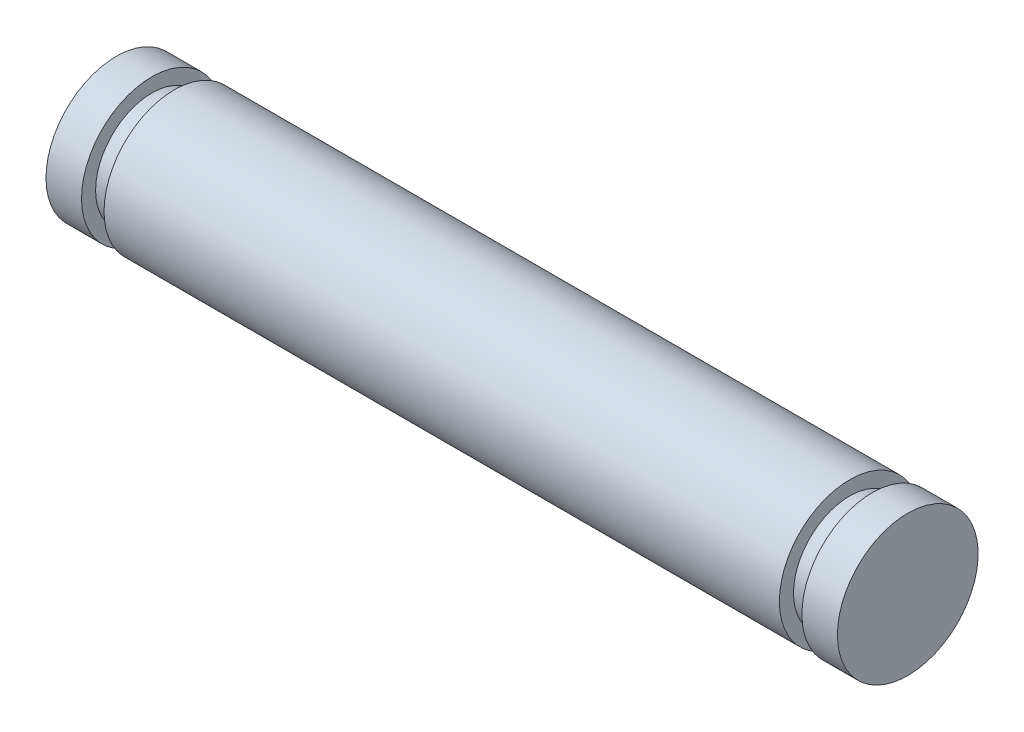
from build123d import *

# Parameters (mm, degrees)
SKETCH1_R           = 2
BOSS_EXTRUDE1_DEPTH = 11.25
SKETCH3_W           = 0.64
SKETCH3_H           = 0.4


with BuildPart() as part:
    # Sketch1 → Boss-Extrude1 (new, symmetric)
    with BuildSketch(Plane(origin=(0, 0, 0), x_dir=(0, 0, -1), z_dir=(1, 0, 0))):
        with Locations(Location((0, 0, 0), (0, 0, 180))):
            Circle(SKETCH1_R)
    extrude(amount=BOSS_EXTRUDE1_DEPTH, both=True)

    # Sketch3 → Cut-Revolve1 (revolve, cut)
    with BuildSketch(Plane(origin=(0, 0, 0), x_dir=(1, 0, 0), z_dir=(0, 1, 0)), mode=Mode.PRIVATE) as cut_revolve1_sk:
        with Locations((-9.92, 1.8)):
            Rectangle(SKETCH3_W, SKETCH3_H)
    cut_revolve1 = revolve(cut_revolve1_sk.sketch.rotate(Axis((-12.375, 0, 0), (1, 0, 0)), 180), axis=Axis((-12.375, 0, 0), (1, 0, 0)), mode=Mode.SUBTRACT)

    # Mirror1: Cut-Revolve1 across plane
    add(cut_revolve1.mirror(Plane(origin=(0, 0, 0), x_dir=(0, 0, 1), z_dir=(1, 0, 0))), mode=Mode.SUBTRACT)


solid = part.part
